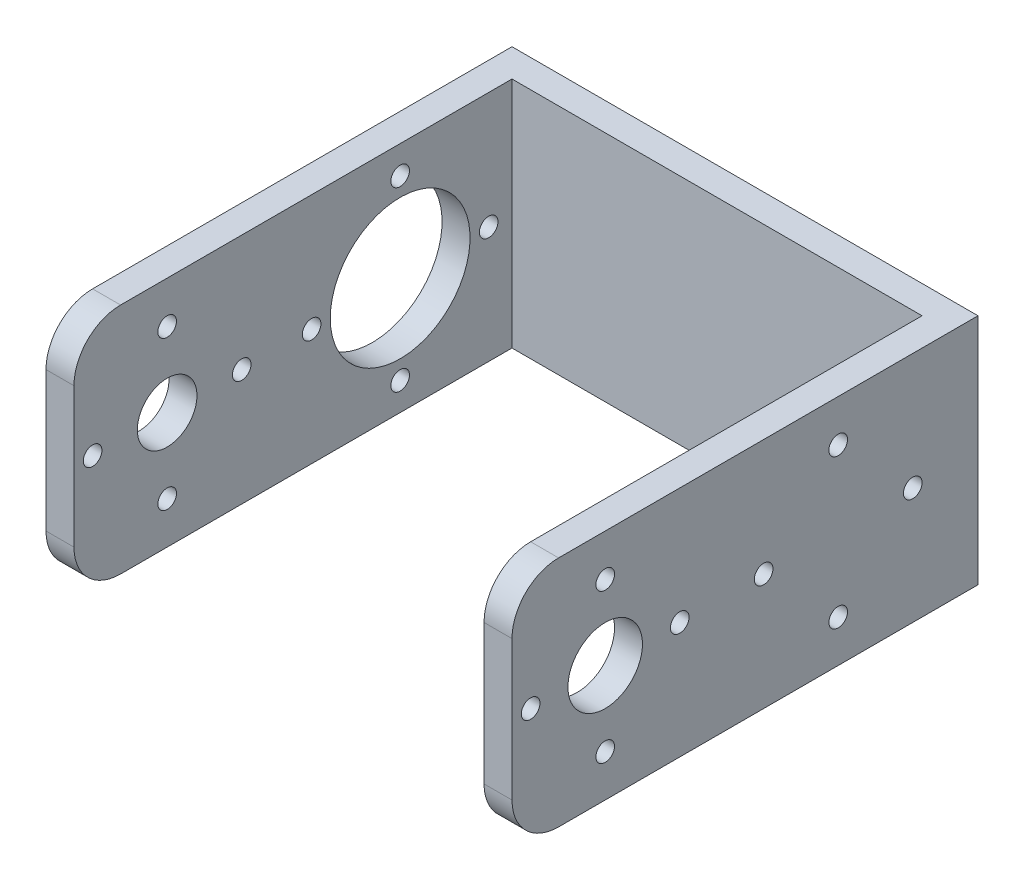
from build123d import *

# Parameters (mm, degrees)
BOSS_EXTRUDE1_DEPTH = 25
CUT_EXTRUDE1_REACH  = 63.237
SKETCH2_R           = 7.5
SKETCH2_R_2         = 1
SKETCH2_R_3         = 3.2
CUT_EXTRUDE2_REACH  = 63.237
SKETCH4_R           = 1
SKETCH4_R_2         = 4
FILLET1_R           = 5


with BuildPart() as part:
    # Sketch1 → Boss-Extrude1 (new body)
    with BuildSketch(Plane(origin=(0, 0, 0), x_dir=(1, 0, 0), z_dir=(0, 1, 0))):
        Polygon((-23, 25), (27, 25), (27, -25), (24, -25), (24, 22), (-20, 22), (-20, -25), (-23, -25), align=None)
    extrude(amount=BOSS_EXTRUDE1_DEPTH)

    # Sketch2 → Cut-Extrude1 (cut, up to next)
    with BuildSketch(Plane.ZY.offset(23), mode=Mode.PRIVATE) as cut_extrude1_sk1:
        with Locations((-10, 12.5)):
            Circle(SKETCH2_R)
    cut_extrude1_tool1 = extrude(cut_extrude1_sk1.sketch, amount=-CUT_EXTRUDE1_REACH, mode=Mode.PRIVATE) & part.part
    # Sketch2 → Cut-Extrude1 (cut, up to next)
    with BuildSketch(Plane.ZY.offset(23), mode=Mode.PRIVATE) as cut_extrude1_sk2:
        with Locations((-10, 22)):
            Circle(SKETCH2_R_2)
    cut_extrude1_tool2 = extrude(cut_extrude1_sk2.sketch, amount=-CUT_EXTRUDE1_REACH, mode=Mode.PRIVATE) & part.part
    # Sketch2 → Cut-Extrude1 (cut, up to next)
    with BuildSketch(Plane.ZY.offset(23), mode=Mode.PRIVATE) as cut_extrude1_sk3:
        with Locations((-0.5, 12.5)):
            Circle(SKETCH2_R_2)
    cut_extrude1_tool3 = extrude(cut_extrude1_sk3.sketch, amount=-CUT_EXTRUDE1_REACH, mode=Mode.PRIVATE) & part.part
    # Sketch2 → Cut-Extrude1 (cut, up to next)
    with BuildSketch(Plane.ZY.offset(23), mode=Mode.PRIVATE) as cut_extrude1_sk4:
        with Locations((-10, 3)):
            Circle(SKETCH2_R_2)
    cut_extrude1_tool4 = extrude(cut_extrude1_sk4.sketch, amount=-CUT_EXTRUDE1_REACH, mode=Mode.PRIVATE) & part.part
    # Sketch2 → Cut-Extrude1 (cut, up to next)
    with BuildSketch(Plane.ZY.offset(23), mode=Mode.PRIVATE) as cut_extrude1_sk5:
        with Locations((-19.5, 12.5)):
            Circle(SKETCH2_R_2)
    cut_extrude1_tool5 = extrude(cut_extrude1_sk5.sketch, amount=-CUT_EXTRUDE1_REACH, mode=Mode.PRIVATE) & part.part
    # Sketch2 → Cut-Extrude1 (cut, up to next)
    with BuildSketch(Plane.ZY.offset(23), mode=Mode.PRIVATE) as cut_extrude1_sk6:
        with Locations((15, 12.5)):
            Circle(SKETCH2_R_3)
    cut_extrude1_tool6 = extrude(cut_extrude1_sk6.sketch, amount=-CUT_EXTRUDE1_REACH, mode=Mode.PRIVATE) & part.part
    # Sketch2 → Cut-Extrude1 (cut, up to next)
    with BuildSketch(Plane.ZY.offset(23), mode=Mode.PRIVATE) as cut_extrude1_sk7:
        with Locations((15, 20.5)):
            Circle(SKETCH2_R_2)
    cut_extrude1_tool7 = extrude(cut_extrude1_sk7.sketch, amount=-CUT_EXTRUDE1_REACH, mode=Mode.PRIVATE) & part.part
    # Sketch2 → Cut-Extrude1 (cut, up to next)
    with BuildSketch(Plane.ZY.offset(23), mode=Mode.PRIVATE) as cut_extrude1_sk8:
        with Locations((23, 12.5)):
            Circle(SKETCH2_R_2)
    cut_extrude1_tool8 = extrude(cut_extrude1_sk8.sketch, amount=-CUT_EXTRUDE1_REACH, mode=Mode.PRIVATE) & part.part
    # Sketch2 → Cut-Extrude1 (cut, up to next)
    with BuildSketch(Plane.ZY.offset(23), mode=Mode.PRIVATE) as cut_extrude1_sk9:
        with Locations((15, 4.5)):
            Circle(SKETCH2_R_2)
    cut_extrude1_tool9 = extrude(cut_extrude1_sk9.sketch, amount=-CUT_EXTRUDE1_REACH, mode=Mode.PRIVATE) & part.part
    # Sketch2 → Cut-Extrude1 (cut, up to next)
    with BuildSketch(Plane.ZY.offset(23), mode=Mode.PRIVATE) as cut_extrude1_sk10:
        with Locations((7, 12.5)):
            Circle(SKETCH2_R_2)
    cut_extrude1_tool10 = extrude(cut_extrude1_sk10.sketch, amount=-CUT_EXTRUDE1_REACH, mode=Mode.PRIVATE) & part.part
    add(cut_extrude1_tool1.solids().sort_by_distance((-23, 12.5, -10))[0], mode=Mode.SUBTRACT)
    add(cut_extrude1_tool2.solids().sort_by_distance((-23, 22, -10))[0], mode=Mode.SUBTRACT)
    add(cut_extrude1_tool3.solids().sort_by_distance((-23, 12.5, -0.5))[0], mode=Mode.SUBTRACT)
    add(cut_extrude1_tool4.solids().sort_by_distance((-23, 3, -10))[0], mode=Mode.SUBTRACT)
    add(cut_extrude1_tool5.solids().sort_by_distance((-23, 12.5, -19.5))[0], mode=Mode.SUBTRACT)
    add(cut_extrude1_tool6.solids().sort_by_distance((-23, 12.5, 15))[0], mode=Mode.SUBTRACT)
    add(cut_extrude1_tool7.solids().sort_by_distance((-23, 20.5, 15))[0], mode=Mode.SUBTRACT)
    add(cut_extrude1_tool8.solids().sort_by_distance((-23, 12.5, 23))[0], mode=Mode.SUBTRACT)
    add(cut_extrude1_tool9.solids().sort_by_distance((-23, 4.5, 15))[0], mode=Mode.SUBTRACT)
    add(cut_extrude1_tool10.solids().sort_by_distance((-23, 12.5, 7))[0], mode=Mode.SUBTRACT)

    # Sketch4 → Cut-Extrude2 (cut, up to next)
    with BuildSketch(Plane(origin=(27, 0, 0), x_dir=(0, 0, -1), z_dir=(1, 0, 0)), mode=Mode.PRIVATE) as cut_extrude2_sk1:
        with Locations((10, 20.5)):
            Circle(SKETCH4_R)
    cut_extrude2_tool1 = extrude(cut_extrude2_sk1.sketch, amount=-CUT_EXTRUDE2_REACH, mode=Mode.PRIVATE) & part.part
    # Sketch4 → Cut-Extrude2 (cut, up to next)
    with BuildSketch(Plane(origin=(27, 0, 0), x_dir=(0, 0, -1), z_dir=(1, 0, 0)), mode=Mode.PRIVATE) as cut_extrude2_sk2:
        with Locations((18, 12.5)):
            Circle(SKETCH4_R)
    cut_extrude2_tool2 = extrude(cut_extrude2_sk2.sketch, amount=-CUT_EXTRUDE2_REACH, mode=Mode.PRIVATE) & part.part
    # Sketch4 → Cut-Extrude2 (cut, up to next)
    with BuildSketch(Plane(origin=(27, 0, 0), x_dir=(0, 0, -1), z_dir=(1, 0, 0)), mode=Mode.PRIVATE) as cut_extrude2_sk3:
        with Locations((2, 12.5)):
            Circle(SKETCH4_R)
    cut_extrude2_tool3 = extrude(cut_extrude2_sk3.sketch, amount=-CUT_EXTRUDE2_REACH, mode=Mode.PRIVATE) & part.part
    # Sketch4 → Cut-Extrude2 (cut, up to next)
    with BuildSketch(Plane(origin=(27, 0, 0), x_dir=(0, 0, -1), z_dir=(1, 0, 0)), mode=Mode.PRIVATE) as cut_extrude2_sk4:
        with Locations((10, 4.5)):
            Circle(SKETCH4_R)
    cut_extrude2_tool4 = extrude(cut_extrude2_sk4.sketch, amount=-CUT_EXTRUDE2_REACH, mode=Mode.PRIVATE) & part.part
    # Sketch4 → Cut-Extrude2 (cut, up to next)
    with BuildSketch(Plane(origin=(27, 0, 0), x_dir=(0, 0, -1), z_dir=(1, 0, 0)), mode=Mode.PRIVATE) as cut_extrude2_sk5:
        with Locations((-15, 12.5)):
            Circle(SKETCH4_R_2)
    cut_extrude2_tool5 = extrude(cut_extrude2_sk5.sketch, amount=-CUT_EXTRUDE2_REACH, mode=Mode.PRIVATE) & part.part
    # Sketch4 → Cut-Extrude2 (cut, up to next)
    with BuildSketch(Plane(origin=(27, 0, 0), x_dir=(0, 0, -1), z_dir=(1, 0, 0)), mode=Mode.PRIVATE) as cut_extrude2_sk6:
        with Locations(Location((-15, 20.5, 0), (0, 0, 180))):
            Circle(SKETCH4_R)
    cut_extrude2_tool6 = extrude(cut_extrude2_sk6.sketch, amount=-CUT_EXTRUDE2_REACH, mode=Mode.PRIVATE) & part.part
    # Sketch4 → Cut-Extrude2 (cut, up to next)
    with BuildSketch(Plane(origin=(27, 0, 0), x_dir=(0, 0, -1), z_dir=(1, 0, 0)), mode=Mode.PRIVATE) as cut_extrude2_sk7:
        with Locations(Location((-7, 12.5, 0), (0, 0, 180))):
            Circle(SKETCH4_R)
    cut_extrude2_tool7 = extrude(cut_extrude2_sk7.sketch, amount=-CUT_EXTRUDE2_REACH, mode=Mode.PRIVATE) & part.part
    # Sketch4 → Cut-Extrude2 (cut, up to next)
    with BuildSketch(Plane(origin=(27, 0, 0), x_dir=(0, 0, -1), z_dir=(1, 0, 0)), mode=Mode.PRIVATE) as cut_extrude2_sk8:
        with Locations(Location((-15, 4.5, 0), (0, 0, 180))):
            Circle(SKETCH4_R)
    cut_extrude2_tool8 = extrude(cut_extrude2_sk8.sketch, amount=-CUT_EXTRUDE2_REACH, mode=Mode.PRIVATE) & part.part
    # Sketch4 → Cut-Extrude2 (cut, up to next)
    with BuildSketch(Plane(origin=(27, 0, 0), x_dir=(0, 0, -1), z_dir=(1, 0, 0)), mode=Mode.PRIVATE) as cut_extrude2_sk9:
        with Locations(Location((-23, 12.5, 0), (0, 0, 180))):
            Circle(SKETCH4_R)
    cut_extrude2_tool9 = extrude(cut_extrude2_sk9.sketch, amount=-CUT_EXTRUDE2_REACH, mode=Mode.PRIVATE) & part.part
    add(cut_extrude2_tool1.solids().sort_by_distance((27, 20.5, -10))[0], mode=Mode.SUBTRACT)
    add(cut_extrude2_tool2.solids().sort_by_distance((27, 12.5, -18))[0], mode=Mode.SUBTRACT)
    add(cut_extrude2_tool3.solids().sort_by_distance((27, 12.5, -2))[0], mode=Mode.SUBTRACT)
    add(cut_extrude2_tool4.solids().sort_by_distance((27, 4.5, -10))[0], mode=Mode.SUBTRACT)
    add(cut_extrude2_tool5.solids().sort_by_distance((27, 12.5, 15))[0], mode=Mode.SUBTRACT)
    add(cut_extrude2_tool6.solids().sort_by_distance((27, 20.5, 15))[0], mode=Mode.SUBTRACT)
    add(cut_extrude2_tool7.solids().sort_by_distance((27, 12.5, 7))[0], mode=Mode.SUBTRACT)
    add(cut_extrude2_tool8.solids().sort_by_distance((27, 4.5, 15))[0], mode=Mode.SUBTRACT)
    add(cut_extrude2_tool9.solids().sort_by_distance((27, 12.5, 23))[0], mode=Mode.SUBTRACT)

    # Fillet1
    fillet1_edges = [part.edges().sort_by_distance(p)[0] for p in [
        (-21.5, 0, 25),
        (-21.5, 25, 25),
        (25.5, 25, 25),
        (25.5, 0, 25),
    ]]
    fillet(fillet1_edges, radius=FILLET1_R)


solid = part.part
